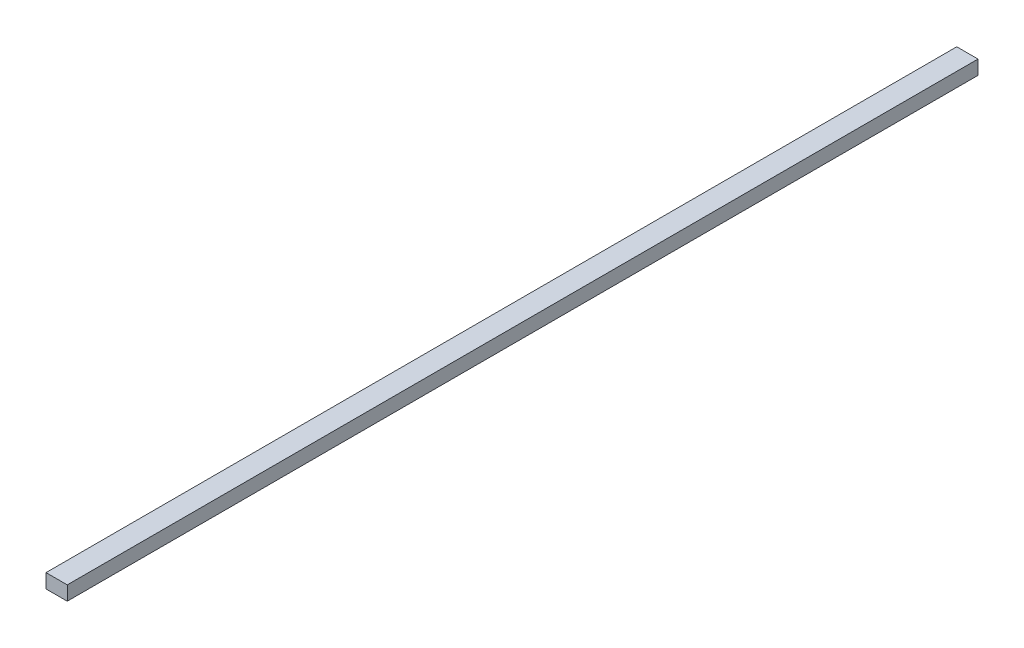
from build123d import *

# Parameters (mm, degrees)
SKETCH1_W           = 42
SKETCH1_H           = 28
BOSS_EXTRUDE1_DEPTH = 1800


with BuildPart() as part:
    # Sketch1 → Boss-Extrude1 (new body)
    with BuildSketch(Plane.XY):
        Rectangle(SKETCH1_W, SKETCH1_H)
    extrude(amount=BOSS_EXTRUDE1_DEPTH)


solid = part.part
